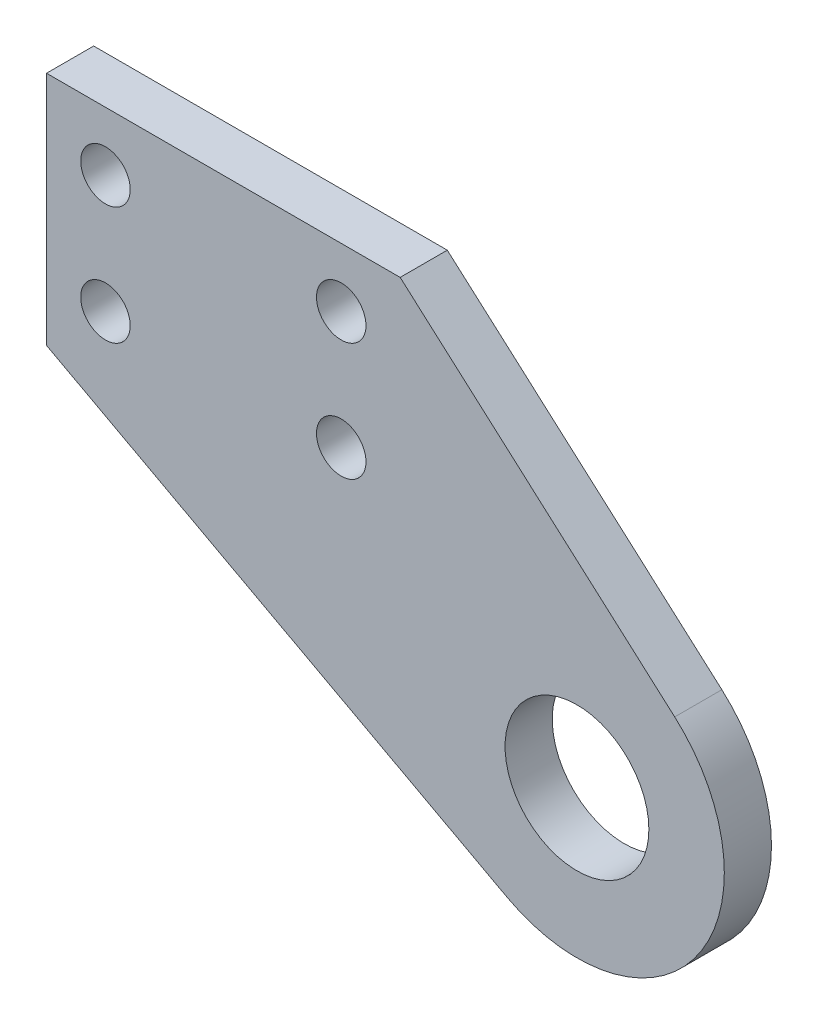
ISO-10303-21;
HEADER;
FILE_DESCRIPTION(('STEP AP214'),'2;1');
FILE_NAME('part.step','',(''),(''),'','','');
FILE_SCHEMA(('AUTOMOTIVE_DESIGN { 1 0 10303 214 1 1 1 1 }'));
ENDSEC;
DATA;
#1=APPLICATION_CONTEXT('core data for automotive mechanical design processes');
#2=APPLICATION_PROTOCOL_DEFINITION('international standard','automotive_design',2000,#1);
#3=PRODUCT_CONTEXT('',#1,'mechanical');
#4=PRODUCT('Part','Part','',(#3));
#5=PRODUCT_RELATED_PRODUCT_CATEGORY('part','',(#4));
#6=PRODUCT_DEFINITION_FORMATION('','',#4);
#7=PRODUCT_DEFINITION_CONTEXT('part definition',#1,'design');
#8=PRODUCT_DEFINITION('design','',#6,#7);
#9=PRODUCT_DEFINITION_SHAPE('','',#8);
#10=(LENGTH_UNIT() NAMED_UNIT(*) SI_UNIT(.MILLI.,.METRE.));
#11=(NAMED_UNIT(*) PLANE_ANGLE_UNIT() SI_UNIT($,.RADIAN.));
#12=(NAMED_UNIT(*) SI_UNIT($,.STERADIAN.) SOLID_ANGLE_UNIT());
#13=UNCERTAINTY_MEASURE_WITH_UNIT(LENGTH_MEASURE(1.E-05),#10,'distance_accuracy_value','');
#14=(GEOMETRIC_REPRESENTATION_CONTEXT(3) GLOBAL_UNCERTAINTY_ASSIGNED_CONTEXT((#13)) GLOBAL_UNIT_ASSIGNED_CONTEXT((#10,
#11,#12)) REPRESENTATION_CONTEXT('',''));
#15=CARTESIAN_POINT('',(0.,0.,0.));
#16=DIRECTION('',(0.,0.,1.));
#17=DIRECTION('',(1.,0.,0.));
#18=AXIS2_PLACEMENT_3D('',#15,#16,#17);
#19=CARTESIAN_POINT('',(0.,0.,0.));
#20=DIRECTION('',(0.,0.,1.));
#21=DIRECTION('',(1.,0.,0.));
#22=AXIS2_PLACEMENT_3D('',#19,#20,#21);
#23=PLANE('',#22);
#24=CARTESIAN_POINT('',(30.,-20.,0.));
#25=DIRECTION('',(0.,0.,1.));
#26=DIRECTION('',(1.,0.,0.));
#27=AXIS2_PLACEMENT_3D('',#24,#25,#26);
#28=CIRCLE('',#27,6.1);
#29=CARTESIAN_POINT('',(36.1,-20.,0.));
#30=VERTEX_POINT('',#29);
#31=EDGE_CURVE('E185',#30,#30,#28,.T.);
#32=ORIENTED_EDGE('',*,*,#31,.T.);
#33=EDGE_LOOP('',(#32));
#34=FACE_BOUND('',#33,.T.);
#35=CARTESIAN_POINT('',(-10.,-5.,0.));
#36=DIRECTION('',(0.,0.,-1.));
#37=DIRECTION('',(1.,0.,0.));
#38=AXIS2_PLACEMENT_3D('',#35,#36,#37);
#39=CIRCLE('',#38,2.1);
#40=CARTESIAN_POINT('',(-7.9,-5.,0.));
#41=VERTEX_POINT('',#40);
#42=EDGE_CURVE('E101',#41,#41,#39,.T.);
#43=ORIENTED_EDGE('',*,*,#42,.F.);
#44=EDGE_LOOP('',(#43));
#45=FACE_BOUND('',#44,.T.);
#46=CARTESIAN_POINT('',(-10.,5.,0.));
#47=DIRECTION('',(0.,0.,1.));
#48=DIRECTION('',(1.,0.,0.));
#49=AXIS2_PLACEMENT_3D('',#46,#47,#48);
#50=CIRCLE('',#49,2.1);
#51=CARTESIAN_POINT('',(-7.9,5.,0.));
#52=VERTEX_POINT('',#51);
#53=EDGE_CURVE('E161',#52,#52,#50,.T.);
#54=ORIENTED_EDGE('',*,*,#53,.T.);
#55=EDGE_LOOP('',(#54));
#56=FACE_BOUND('',#55,.T.);
#57=CARTESIAN_POINT('',(10.,5.,0.));
#58=DIRECTION('',(0.,0.,-1.));
#59=DIRECTION('',(1.,0.,0.));
#60=AXIS2_PLACEMENT_3D('',#57,#58,#59);
#61=CIRCLE('',#60,2.1);
#62=CARTESIAN_POINT('',(12.1,5.,0.));
#63=VERTEX_POINT('',#62);
#64=EDGE_CURVE('E169',#63,#63,#61,.T.);
#65=ORIENTED_EDGE('',*,*,#64,.F.);
#66=EDGE_LOOP('',(#65));
#67=FACE_BOUND('',#66,.T.);
#68=CARTESIAN_POINT('',(10.,-5.,0.));
#69=DIRECTION('',(0.,0.,1.));
#70=DIRECTION('',(1.,0.,0.));
#71=AXIS2_PLACEMENT_3D('',#68,#69,#70);
#72=CIRCLE('',#71,2.1);
#73=CARTESIAN_POINT('',(12.1,-5.,0.));
#74=VERTEX_POINT('',#73);
#75=EDGE_CURVE('E170',#74,#74,#72,.T.);
#76=ORIENTED_EDGE('',*,*,#75,.T.);
#77=EDGE_LOOP('',(#76));
#78=FACE_BOUND('',#77,.T.);
#79=DIRECTION('',(0.,1.,0.));
#80=VECTOR('',#79,1.);
#81=CARTESIAN_POINT('',(-15.,0.,0.));
#82=LINE('',#81,#80);
#83=CARTESIAN_POINT('',(-15.,-10.,0.));
#84=VERTEX_POINT('',#83);
#85=CARTESIAN_POINT('',(-15.,10.,0.));
#86=VERTEX_POINT('',#85);
#87=EDGE_CURVE('E91',#84,#86,#82,.T.);
#88=ORIENTED_EDGE('',*,*,#87,.T.);
#89=DIRECTION('',(1.,0.,0.));
#90=VECTOR('',#89,1.);
#91=CARTESIAN_POINT('',(0.,10.,0.));
#92=LINE('',#91,#90);
#93=CARTESIAN_POINT('',(15.,10.,0.));
#94=VERTEX_POINT('',#93);
#95=EDGE_CURVE('E25',#86,#94,#92,.T.);
#96=ORIENTED_EDGE('',*,*,#95,.T.);
#97=DIRECTION('',(0.748329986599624,-0.663326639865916,0.));
#98=VECTOR('',#97,1.);
#99=CARTESIAN_POINT('',(11.5639056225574,13.0457859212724,0.));
#100=LINE('',#99,#98);
#101=CARTESIAN_POINT('',(38.291582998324,-10.6458751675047,0.));
#102=VERTEX_POINT('',#101);
#103=EDGE_CURVE('E137',#94,#102,#100,.T.);
#104=ORIENTED_EDGE('',*,*,#103,.T.);
#105=CARTESIAN_POINT('',(30.,-20.,0.));
#106=DIRECTION('',(0.,0.,1.));
#107=DIRECTION('',(1.,0.,0.));
#108=AXIS2_PLACEMENT_3D('',#105,#106,#107);
#109=CIRCLE('',#108,12.5);
#110=CARTESIAN_POINT('',(24.081141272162,-31.0098642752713,0.));
#111=VERTEX_POINT('',#110);
#112=EDGE_CURVE('E125',#111,#102,#109,.T.);
#113=ORIENTED_EDGE('',*,*,#112,.F.);
#114=DIRECTION('',(0.880789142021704,-0.473508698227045,0.));
#115=VECTOR('',#114,1.);
#116=CARTESIAN_POINT('',(-7.5337705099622,-14.0138149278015,0.));
#117=LINE('',#116,#115);
#118=EDGE_CURVE('E95',#84,#111,#117,.T.);
#119=ORIENTED_EDGE('',*,*,#118,.F.);
#120=EDGE_LOOP('',(#88,#96,#104,#113,#119));
#121=FACE_BOUND('',#120,.T.);
#122=ADVANCED_FACE('F17',(#34,#45,#56,#67,#78,#121),#23,.F.);
#123=CARTESIAN_POINT('',(0.,0.,4.));
#124=DIRECTION('',(0.,0.,1.));
#125=DIRECTION('',(1.,0.,0.));
#126=AXIS2_PLACEMENT_3D('',#123,#124,#125);
#127=PLANE('',#126);
#128=CARTESIAN_POINT('',(30.,-20.,4.));
#129=DIRECTION('',(0.,0.,1.));
#130=DIRECTION('',(1.,0.,0.));
#131=AXIS2_PLACEMENT_3D('',#128,#129,#130);
#132=CIRCLE('',#131,6.1);
#133=CARTESIAN_POINT('',(36.1,-20.,4.));
#134=VERTEX_POINT('',#133);
#135=EDGE_CURVE('E189',#134,#134,#132,.T.);
#136=ORIENTED_EDGE('',*,*,#135,.F.);
#137=EDGE_LOOP('',(#136));
#138=FACE_BOUND('',#137,.T.);
#139=CARTESIAN_POINT('',(-10.,-5.,4.));
#140=DIRECTION('',(0.,0.,-1.));
#141=DIRECTION('',(1.,0.,0.));
#142=AXIS2_PLACEMENT_3D('',#139,#140,#141);
#143=CIRCLE('',#142,2.1);
#144=CARTESIAN_POINT('',(-7.9,-5.,4.));
#145=VERTEX_POINT('',#144);
#146=EDGE_CURVE('E111',#145,#145,#143,.T.);
#147=ORIENTED_EDGE('',*,*,#146,.T.);
#148=EDGE_LOOP('',(#147));
#149=FACE_BOUND('',#148,.T.);
#150=CARTESIAN_POINT('',(-10.,5.,4.));
#151=DIRECTION('',(0.,0.,1.));
#152=DIRECTION('',(1.,0.,0.));
#153=AXIS2_PLACEMENT_3D('',#150,#151,#152);
#154=CIRCLE('',#153,2.1);
#155=CARTESIAN_POINT('',(-7.9,5.,4.));
#156=VERTEX_POINT('',#155);
#157=EDGE_CURVE('E165',#156,#156,#154,.T.);
#158=ORIENTED_EDGE('',*,*,#157,.F.);
#159=EDGE_LOOP('',(#158));
#160=FACE_BOUND('',#159,.T.);
#161=CARTESIAN_POINT('',(10.,5.,4.));
#162=DIRECTION('',(0.,0.,-1.));
#163=DIRECTION('',(1.,0.,0.));
#164=AXIS2_PLACEMENT_3D('',#161,#162,#163);
#165=CIRCLE('',#164,2.1);
#166=CARTESIAN_POINT('',(12.1,5.,4.));
#167=VERTEX_POINT('',#166);
#168=EDGE_CURVE('E166',#167,#167,#165,.T.);
#169=ORIENTED_EDGE('',*,*,#168,.T.);
#170=EDGE_LOOP('',(#169));
#171=FACE_BOUND('',#170,.T.);
#172=CARTESIAN_POINT('',(10.,-5.,4.));
#173=DIRECTION('',(0.,0.,1.));
#174=DIRECTION('',(1.,0.,0.));
#175=AXIS2_PLACEMENT_3D('',#172,#173,#174);
#176=CIRCLE('',#175,2.1);
#177=CARTESIAN_POINT('',(12.1,-5.,4.));
#178=VERTEX_POINT('',#177);
#179=EDGE_CURVE('E181',#178,#178,#176,.T.);
#180=ORIENTED_EDGE('',*,*,#179,.F.);
#181=EDGE_LOOP('',(#180));
#182=FACE_BOUND('',#181,.T.);
#183=DIRECTION('',(0.,1.,0.));
#184=VECTOR('',#183,1.);
#185=CARTESIAN_POINT('',(-15.,0.,4.));
#186=LINE('',#185,#184);
#187=CARTESIAN_POINT('',(-15.,-10.,4.));
#188=VERTEX_POINT('',#187);
#189=CARTESIAN_POINT('',(-15.,10.,4.));
#190=VERTEX_POINT('',#189);
#191=EDGE_CURVE('E93',#188,#190,#186,.T.);
#192=ORIENTED_EDGE('',*,*,#191,.F.);
#193=DIRECTION('',(0.880789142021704,-0.473508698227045,0.));
#194=VECTOR('',#193,1.);
#195=CARTESIAN_POINT('',(-7.5337705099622,-14.0138149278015,4.));
#196=LINE('',#195,#194);
#197=CARTESIAN_POINT('',(24.081141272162,-31.0098642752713,4.));
#198=VERTEX_POINT('',#197);
#199=EDGE_CURVE('E121',#188,#198,#196,.T.);
#200=ORIENTED_EDGE('',*,*,#199,.T.);
#201=CARTESIAN_POINT('',(30.,-20.,4.));
#202=DIRECTION('',(0.,0.,1.));
#203=DIRECTION('',(1.,0.,0.));
#204=AXIS2_PLACEMENT_3D('',#201,#202,#203);
#205=CIRCLE('',#204,12.5);
#206=CARTESIAN_POINT('',(38.291582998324,-10.6458751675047,4.));
#207=VERTEX_POINT('',#206);
#208=EDGE_CURVE('E133',#198,#207,#205,.T.);
#209=ORIENTED_EDGE('',*,*,#208,.T.);
#210=DIRECTION('',(0.748329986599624,-0.663326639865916,0.));
#211=VECTOR('',#210,1.);
#212=CARTESIAN_POINT('',(11.5639056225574,13.0457859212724,4.));
#213=LINE('',#212,#211);
#214=CARTESIAN_POINT('',(15.,10.,4.));
#215=VERTEX_POINT('',#214);
#216=EDGE_CURVE('E85',#215,#207,#213,.T.);
#217=ORIENTED_EDGE('',*,*,#216,.F.);
#218=DIRECTION('',(1.,0.,0.));
#219=VECTOR('',#218,1.);
#220=CARTESIAN_POINT('',(0.,10.,4.));
#221=LINE('',#220,#219);
#222=EDGE_CURVE('E11',#190,#215,#221,.T.);
#223=ORIENTED_EDGE('',*,*,#222,.F.);
#224=EDGE_LOOP('',(#192,#200,#209,#217,#223));
#225=FACE_BOUND('',#224,.T.);
#226=ADVANCED_FACE('F148',(#138,#149,#160,#171,#182,#225),#127,.T.);
#227=CARTESIAN_POINT('',(0.,10.,4.));
#228=DIRECTION('',(0.,1.,0.));
#229=DIRECTION('',(1.,0.,0.));
#230=AXIS2_PLACEMENT_3D('',#227,#228,#229);
#231=PLANE('',#230);
#232=ORIENTED_EDGE('',*,*,#95,.F.);
#233=DIRECTION('',(0.,0.,-1.));
#234=VECTOR('',#233,1.);
#235=CARTESIAN_POINT('',(-15.,10.,4.));
#236=LINE('',#235,#234);
#237=EDGE_CURVE('E79',#190,#86,#236,.T.);
#238=ORIENTED_EDGE('',*,*,#237,.F.);
#239=ORIENTED_EDGE('',*,*,#222,.T.);
#240=DIRECTION('',(0.,0.,-1.));
#241=VECTOR('',#240,1.);
#242=CARTESIAN_POINT('',(15.,10.,4.));
#243=LINE('',#242,#241);
#244=EDGE_CURVE('E82',#215,#94,#243,.T.);
#245=ORIENTED_EDGE('',*,*,#244,.T.);
#246=EDGE_LOOP('',(#232,#238,#239,#245));
#247=FACE_BOUND('',#246,.T.);
#248=ADVANCED_FACE('F78',(#247),#231,.T.);
#249=CARTESIAN_POINT('',(11.5639056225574,13.0457859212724,4.));
#250=DIRECTION('',(0.663326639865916,0.748329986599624,0.));
#251=DIRECTION('',(0.,0.,-1.));
#252=AXIS2_PLACEMENT_3D('',#249,#250,#251);
#253=PLANE('',#252);
#254=ORIENTED_EDGE('',*,*,#103,.F.);
#255=ORIENTED_EDGE('',*,*,#244,.F.);
#256=ORIENTED_EDGE('',*,*,#216,.T.);
#257=DIRECTION('',(0.,0.,-1.));
#258=VECTOR('',#257,1.);
#259=CARTESIAN_POINT('',(38.291582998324,-10.6458751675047,4.));
#260=LINE('',#259,#258);
#261=EDGE_CURVE('E129',#207,#102,#260,.T.);
#262=ORIENTED_EDGE('',*,*,#261,.T.);
#263=EDGE_LOOP('',(#254,#255,#256,#262));
#264=FACE_BOUND('',#263,.T.);
#265=ADVANCED_FACE('F145',(#264),#253,.T.);
#266=CARTESIAN_POINT('',(30.,-20.,4.));
#267=DIRECTION('',(0.,0.,-1.));
#268=DIRECTION('',(-1.,0.,0.));
#269=AXIS2_PLACEMENT_3D('',#266,#267,#268);
#270=CYLINDRICAL_SURFACE('',#269,12.5);
#271=ORIENTED_EDGE('',*,*,#112,.T.);
#272=ORIENTED_EDGE('',*,*,#261,.F.);
#273=ORIENTED_EDGE('',*,*,#208,.F.);
#274=DIRECTION('',(0.,0.,-1.));
#275=VECTOR('',#274,1.);
#276=CARTESIAN_POINT('',(24.081141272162,-31.0098642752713,4.));
#277=LINE('',#276,#275);
#278=EDGE_CURVE('E117',#198,#111,#277,.T.);
#279=ORIENTED_EDGE('',*,*,#278,.T.);
#280=EDGE_LOOP('',(#271,#272,#273,#279));
#281=FACE_BOUND('',#280,.T.);
#282=ADVANCED_FACE('F151',(#281),#270,.T.);
#283=CARTESIAN_POINT('',(-7.5337705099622,-14.0138149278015,4.));
#284=DIRECTION('',(0.473508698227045,0.880789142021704,0.));
#285=DIRECTION('',(0.,0.,-1.));
#286=AXIS2_PLACEMENT_3D('',#283,#284,#285);
#287=PLANE('',#286);
#288=ORIENTED_EDGE('',*,*,#118,.T.);
#289=ORIENTED_EDGE('',*,*,#278,.F.);
#290=ORIENTED_EDGE('',*,*,#199,.F.);
#291=DIRECTION('',(0.,0.,-1.));
#292=VECTOR('',#291,1.);
#293=CARTESIAN_POINT('',(-15.,-10.,4.));
#294=LINE('',#293,#292);
#295=EDGE_CURVE('E100',#188,#84,#294,.T.);
#296=ORIENTED_EDGE('',*,*,#295,.T.);
#297=EDGE_LOOP('',(#288,#289,#290,#296));
#298=FACE_BOUND('',#297,.T.);
#299=ADVANCED_FACE('F153',(#298),#287,.F.);
#300=CARTESIAN_POINT('',(-15.,0.,4.));
#301=DIRECTION('',(-1.,0.,0.));
#302=DIRECTION('',(0.,0.,1.));
#303=AXIS2_PLACEMENT_3D('',#300,#301,#302);
#304=PLANE('',#303);
#305=ORIENTED_EDGE('',*,*,#87,.F.);
#306=ORIENTED_EDGE('',*,*,#295,.F.);
#307=ORIENTED_EDGE('',*,*,#191,.T.);
#308=ORIENTED_EDGE('',*,*,#237,.T.);
#309=EDGE_LOOP('',(#305,#306,#307,#308));
#310=FACE_BOUND('',#309,.T.);
#311=ADVANCED_FACE('F89',(#310),#304,.T.);
#312=CARTESIAN_POINT('',(-10.,-5.,4.));
#313=DIRECTION('',(0.,0.,-1.));
#314=DIRECTION('',(-1.,0.,0.));
#315=AXIS2_PLACEMENT_3D('',#312,#313,#314);
#316=CYLINDRICAL_SURFACE('',#315,2.1);
#317=ORIENTED_EDGE('',*,*,#42,.T.);
#318=EDGE_LOOP('',(#317));
#319=FACE_BOUND('',#318,.T.);
#320=ORIENTED_EDGE('',*,*,#146,.F.);
#321=EDGE_LOOP('',(#320));
#322=FACE_BOUND('',#321,.T.);
#323=ADVANCED_FACE('F241',(#319,#322),#316,.F.);
#324=CARTESIAN_POINT('',(-10.,5.,4.));
#325=DIRECTION('',(0.,0.,-1.));
#326=DIRECTION('',(-1.,0.,0.));
#327=AXIS2_PLACEMENT_3D('',#324,#325,#326);
#328=CYLINDRICAL_SURFACE('',#327,2.1);
#329=ORIENTED_EDGE('',*,*,#53,.F.);
#330=EDGE_LOOP('',(#329));
#331=FACE_BOUND('',#330,.T.);
#332=ORIENTED_EDGE('',*,*,#157,.T.);
#333=EDGE_LOOP('',(#332));
#334=FACE_BOUND('',#333,.T.);
#335=ADVANCED_FACE('F220',(#331,#334),#328,.F.);
#336=CARTESIAN_POINT('',(10.,5.,4.));
#337=DIRECTION('',(0.,0.,-1.));
#338=DIRECTION('',(-1.,0.,0.));
#339=AXIS2_PLACEMENT_3D('',#336,#337,#338);
#340=CYLINDRICAL_SURFACE('',#339,2.1);
#341=ORIENTED_EDGE('',*,*,#64,.T.);
#342=EDGE_LOOP('',(#341));
#343=FACE_BOUND('',#342,.T.);
#344=ORIENTED_EDGE('',*,*,#168,.F.);
#345=EDGE_LOOP('',(#344));
#346=FACE_BOUND('',#345,.T.);
#347=ADVANCED_FACE('F210',(#343,#346),#340,.F.);
#348=CARTESIAN_POINT('',(10.,-5.,4.));
#349=DIRECTION('',(0.,0.,-1.));
#350=DIRECTION('',(-1.,0.,0.));
#351=AXIS2_PLACEMENT_3D('',#348,#349,#350);
#352=CYLINDRICAL_SURFACE('',#351,2.1);
#353=ORIENTED_EDGE('',*,*,#75,.F.);
#354=EDGE_LOOP('',(#353));
#355=FACE_BOUND('',#354,.T.);
#356=ORIENTED_EDGE('',*,*,#179,.T.);
#357=EDGE_LOOP('',(#356));
#358=FACE_BOUND('',#357,.T.);
#359=ADVANCED_FACE('F208',(#355,#358),#352,.F.);
#360=CARTESIAN_POINT('',(30.,-20.,4.));
#361=DIRECTION('',(0.,0.,-1.));
#362=DIRECTION('',(-1.,0.,0.));
#363=AXIS2_PLACEMENT_3D('',#360,#361,#362);
#364=CYLINDRICAL_SURFACE('',#363,6.1);
#365=ORIENTED_EDGE('',*,*,#31,.F.);
#366=EDGE_LOOP('',(#365));
#367=FACE_BOUND('',#366,.T.);
#368=ORIENTED_EDGE('',*,*,#135,.T.);
#369=EDGE_LOOP('',(#368));
#370=FACE_BOUND('',#369,.T.);
#371=ADVANCED_FACE('F196',(#367,#370),#364,.F.);
#372=CLOSED_SHELL('',(#122,#226,#248,#265,#282,#299,#311,#323,#335,#347,#359,#371));
#373=MANIFOLD_SOLID_BREP('B1',#372);
#374=ADVANCED_BREP_SHAPE_REPRESENTATION('',(#18,#373),#14);
#375=SHAPE_DEFINITION_REPRESENTATION(#9,#374);
ENDSEC;
END-ISO-10303-21;
